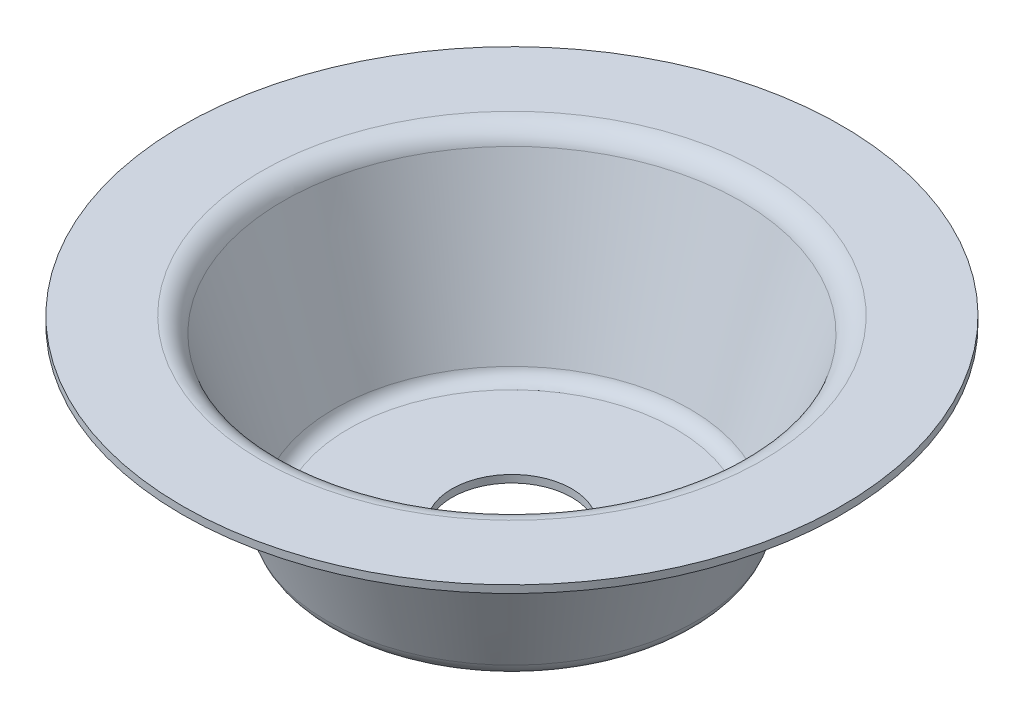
from build123d import *

# Parameters (mm, degrees)
SKETCH2_R          = 12.7
CUT_EXTRUDE1_DEPTH = 107.457233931


with BuildPart() as part:
    # Sketch1 → Revolve-Thin1 (revolve)
    with BuildSketch(Plane.XY, mode=Mode.PRIVATE) as revolve_thin1_sk:
        with BuildLine():
            Line((0, 0), (-34.667384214, 0))
            ThreePointArc((-34.667384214, 0), (-37.452066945, 0.898959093), (-39.185488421, 3.256465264))
            Line((-39.185488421, 3.256465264), (-50.076341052, 35.929023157))
            ThreePointArc((-50.076341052, 35.929023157), (-51.23195537, 37.500693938), (-53.088410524, 38.1))
            Line((-53.088410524, 38.1), (-69.85, 38.1))
            Line((-69.85, 38.1), (-69.85, 39.6875))
            Line((-69.85, 39.6875), (-53.088410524, 39.6875))
            ThreePointArc((-53.088410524, 39.6875), (-50.303727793, 38.788540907), (-48.570306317, 36.431034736))
            Line((-48.570306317, 36.431034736), (-37.679453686, 3.758476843))
            ThreePointArc((-37.679453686, 3.758476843), (-36.523839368, 2.186806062), (-34.667384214, 1.5875))
            Line((-34.667384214, 1.5875), (0, 1.5875))
            Line((0, 1.5875), (0, 0))
        make_face()
    revolve(revolve_thin1_sk.sketch.rotate(Axis((0, 40.501267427, 0), (0, -1, 0)), 270), axis=Axis((0, 40.501267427, 0), (0, -1, 0)))

    # Sketch2 → Cut-Extrude1 (cut, through all)
    with BuildSketch(Plane.XZ):
        with Locations(Location((0, 0, 0), (0, 0, 270))):
            Circle(SKETCH2_R)
    extrude(amount=-CUT_EXTRUDE1_DEPTH, mode=Mode.SUBTRACT)


solid = part.part
